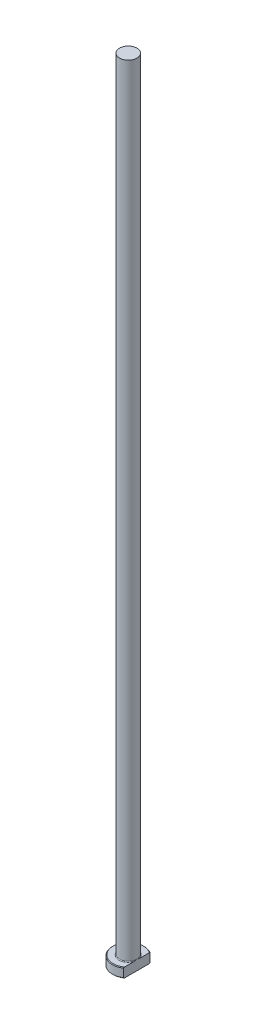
ISO-10303-21;
HEADER;
FILE_DESCRIPTION(('STEP AP214'),'2;1');
FILE_NAME('part.step','',(''),(''),'','','');
FILE_SCHEMA(('AUTOMOTIVE_DESIGN { 1 0 10303 214 1 1 1 1 }'));
ENDSEC;
DATA;
#1=APPLICATION_CONTEXT('core data for automotive mechanical design processes');
#2=APPLICATION_PROTOCOL_DEFINITION('international standard','automotive_design',2000,#1);
#3=PRODUCT_CONTEXT('',#1,'mechanical');
#4=PRODUCT('Part','Part','',(#3));
#5=PRODUCT_RELATED_PRODUCT_CATEGORY('part','',(#4));
#6=PRODUCT_DEFINITION_FORMATION('','',#4);
#7=PRODUCT_DEFINITION_CONTEXT('part definition',#1,'design');
#8=PRODUCT_DEFINITION('design','',#6,#7);
#9=PRODUCT_DEFINITION_SHAPE('','',#8);
#10=(LENGTH_UNIT() NAMED_UNIT(*) SI_UNIT(.MILLI.,.METRE.));
#11=(NAMED_UNIT(*) PLANE_ANGLE_UNIT() SI_UNIT($,.RADIAN.));
#12=(NAMED_UNIT(*) SI_UNIT($,.STERADIAN.) SOLID_ANGLE_UNIT());
#13=UNCERTAINTY_MEASURE_WITH_UNIT(LENGTH_MEASURE(1.E-05),#10,'distance_accuracy_value','');
#14=(GEOMETRIC_REPRESENTATION_CONTEXT(3) GLOBAL_UNCERTAINTY_ASSIGNED_CONTEXT((#13)) GLOBAL_UNIT_ASSIGNED_CONTEXT((#10,
#11,#12)) REPRESENTATION_CONTEXT('',''));
#15=CARTESIAN_POINT('',(0.,0.,0.));
#16=DIRECTION('',(0.,0.,1.));
#17=DIRECTION('',(1.,0.,0.));
#18=AXIS2_PLACEMENT_3D('',#15,#16,#17);
#19=CARTESIAN_POINT('',(0.,0.,0.));
#20=DIRECTION('',(0.,-1.,0.));
#21=DIRECTION('',(0.,0.,-1.));
#22=AXIS2_PLACEMENT_3D('',#19,#20,#21);
#23=PLANE('',#22);
#24=CARTESIAN_POINT('',(0.,0.,0.));
#25=DIRECTION('',(0.,-1.,0.));
#26=DIRECTION('',(0.,0.,-1.));
#27=AXIS2_PLACEMENT_3D('',#24,#25,#26);
#28=CIRCLE('',#27,4.79999999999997);
#29=CARTESIAN_POINT('',(2.74999999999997,0.,3.93414539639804));
#30=VERTEX_POINT('',#29);
#31=CARTESIAN_POINT('',(2.74999999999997,0.,-3.93414539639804));
#32=VERTEX_POINT('',#31);
#33=EDGE_CURVE('E98',#30,#32,#28,.T.);
#34=ORIENTED_EDGE('',*,*,#33,.T.);
#35=DIRECTION('',(0.,0.,1.));
#36=VECTOR('',#35,1.);
#37=CARTESIAN_POINT('',(2.74999999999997,0.,-4.1758232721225));
#38=LINE('',#37,#36);
#39=EDGE_CURVE('E83',#32,#30,#38,.T.);
#40=ORIENTED_EDGE('',*,*,#39,.T.);
#41=EDGE_LOOP('',(#34,#40));
#42=FACE_BOUND('',#41,.T.);
#43=ADVANCED_FACE('F32',(#42),#23,.T.);
#44=CARTESIAN_POINT('',(0.,259.958771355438,0.));
#45=DIRECTION('',(0.,1.,0.));
#46=DIRECTION('',(0.,0.,1.));
#47=AXIS2_PLACEMENT_3D('',#44,#45,#46);
#48=CYLINDRICAL_SURFACE('',#47,4.99999999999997);
#49=CARTESIAN_POINT('',(0.,2.79999999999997,0.));
#50=DIRECTION('',(0.,1.,0.));
#51=DIRECTION('',(0.,0.,1.));
#52=AXIS2_PLACEMENT_3D('',#49,#50,#51);
#53=CIRCLE('',#52,4.99999999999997);
#54=CARTESIAN_POINT('',(2.74999999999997,2.79999999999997,4.1758232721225));
#55=VERTEX_POINT('',#54);
#56=CARTESIAN_POINT('',(2.74999999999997,2.79999999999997,-4.1758232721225));
#57=VERTEX_POINT('',#56);
#58=EDGE_CURVE('E104',#55,#57,#53,.F.);
#59=ORIENTED_EDGE('',*,*,#58,.T.);
#60=DIRECTION('',(0.,-1.,0.));
#61=VECTOR('',#60,1.);
#62=CARTESIAN_POINT('',(2.74999999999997,250.,-4.1758232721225));
#63=LINE('',#62,#61);
#64=CARTESIAN_POINT('',(2.74999999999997,0.200000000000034,-4.1758232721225));
#65=VERTEX_POINT('',#64);
#66=EDGE_CURVE('E183',#57,#65,#63,.T.);
#67=ORIENTED_EDGE('',*,*,#66,.T.);
#68=CARTESIAN_POINT('',(0.,0.200000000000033,0.));
#69=DIRECTION('',(0.,-1.,0.));
#70=DIRECTION('',(0.,0.,-1.));
#71=AXIS2_PLACEMENT_3D('',#68,#69,#70);
#72=CIRCLE('',#71,4.99999999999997);
#73=CARTESIAN_POINT('',(2.74999999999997,0.200000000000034,4.1758232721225));
#74=VERTEX_POINT('',#73);
#75=EDGE_CURVE('E100',#65,#74,#72,.F.);
#76=ORIENTED_EDGE('',*,*,#75,.T.);
#77=DIRECTION('',(0.,-1.,0.));
#78=VECTOR('',#77,1.);
#79=CARTESIAN_POINT('',(2.74999999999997,250.,4.1758232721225));
#80=LINE('',#79,#78);
#81=EDGE_CURVE('E93',#55,#74,#80,.T.);
#82=ORIENTED_EDGE('',*,*,#81,.F.);
#83=EDGE_LOOP('',(#59,#67,#76,#82));
#84=FACE_BOUND('',#83,.T.);
#85=ADVANCED_FACE('F158',(#84),#48,.T.);
#86=CARTESIAN_POINT('',(-4.99999999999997,3.,0.));
#87=DIRECTION('',(0.,1.,0.));
#88=DIRECTION('',(0.,0.,1.));
#89=AXIS2_PLACEMENT_3D('',#86,#87,#88);
#90=PLANE('',#89);
#91=CARTESIAN_POINT('',(0.,3.,0.));
#92=DIRECTION('',(0.,1.,0.));
#93=DIRECTION('',(0.,0.,1.));
#94=AXIS2_PLACEMENT_3D('',#91,#92,#93);
#95=CIRCLE('',#94,4.79999999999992);
#96=CARTESIAN_POINT('',(2.74999999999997,3.,-3.93414539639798));
#97=VERTEX_POINT('',#96);
#98=CARTESIAN_POINT('',(2.74999999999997,3.,3.93414539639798));
#99=VERTEX_POINT('',#98);
#100=EDGE_CURVE('E178',#97,#99,#95,.T.);
#101=ORIENTED_EDGE('',*,*,#100,.T.);
#102=DIRECTION('',(0.,0.,-1.));
#103=VECTOR('',#102,1.);
#104=CARTESIAN_POINT('',(2.74999999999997,3.,0.));
#105=LINE('',#104,#103);
#106=CARTESIAN_POINT('',(2.74999999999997,2.99999999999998,1.06770782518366));
#107=VERTEX_POINT('',#106);
#108=EDGE_CURVE('E57',#99,#107,#105,.T.);
#109=ORIENTED_EDGE('',*,*,#108,.T.);
#110=CARTESIAN_POINT('',(0.,3.,0.));
#111=DIRECTION('',(0.,1.,0.));
#112=DIRECTION('',(0.,0.,1.));
#113=AXIS2_PLACEMENT_3D('',#110,#111,#112);
#114=CIRCLE('',#113,2.94999999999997);
#115=CARTESIAN_POINT('',(2.74999999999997,2.99999999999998,-1.06770782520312));
#116=VERTEX_POINT('',#115);
#117=EDGE_CURVE('E107',#107,#116,#114,.F.);
#118=ORIENTED_EDGE('',*,*,#117,.T.);
#119=EDGE_CURVE('E136',#116,#97,#105,.T.);
#120=ORIENTED_EDGE('',*,*,#119,.T.);
#121=EDGE_LOOP('',(#101,#109,#118,#120));
#122=FACE_BOUND('',#121,.T.);
#123=ADVANCED_FACE('F147',(#122),#90,.T.);
#124=CARTESIAN_POINT('',(0.,3.,0.));
#125=DIRECTION('',(0.,-1.,0.));
#126=DIRECTION('',(0.,0.,-1.));
#127=AXIS2_PLACEMENT_3D('',#124,#125,#126);
#128=CONICAL_SURFACE('',#127,4.79999999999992,0.785398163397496);
#129=ORIENTED_EDGE('',*,*,#58,.F.);
#130=CARTESIAN_POINT('',(2.74999999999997,-1.79114558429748,9.18844783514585));
#131=CARTESIAN_POINT('',(2.74999999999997,-1.62476324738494,9.0147689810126));
#132=CARTESIAN_POINT('',(2.74999999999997,-1.45857819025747,8.84090089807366));
#133=CARTESIAN_POINT('',(2.74999999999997,-1.12668775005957,8.49270511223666));
#134=CARTESIAN_POINT('',(2.74999999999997,-0.960982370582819,8.31837740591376));
#135=CARTESIAN_POINT('',(2.74999999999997,-0.464632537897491,7.79449769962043));
#136=CARTESIAN_POINT('',(2.74999999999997,-0.134839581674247,7.44413786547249));
#137=CARTESIAN_POINT('',(2.74999999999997,0.521406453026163,6.74030951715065));
#138=CARTESIAN_POINT('',(2.74999999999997,0.847859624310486,6.38684108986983));
#139=CARTESIAN_POINT('',(2.74999999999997,1.33353933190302,5.85303151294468));
#140=CARTESIAN_POINT('',(2.74999999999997,1.49475728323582,5.67450358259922));
#141=CARTESIAN_POINT('',(2.74999999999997,1.81545552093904,5.31589537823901));
#142=CARTESIAN_POINT('',(2.74999999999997,1.97493583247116,5.1358151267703));
#143=CARTESIAN_POINT('',(2.74999999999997,2.28246157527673,4.78409714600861));
#144=CARTESIAN_POINT('',(2.74999999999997,2.43063567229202,4.61257212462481));
#145=CARTESIAN_POINT('',(2.74999999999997,2.72427023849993,4.26717959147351));
#146=CARTESIAN_POINT('',(2.74999999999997,2.86973045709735,4.09331186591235));
#147=CARTESIAN_POINT('',(2.74999999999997,3.15716227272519,3.74214491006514));
#148=CARTESIAN_POINT('',(2.74999999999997,3.29912659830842,3.56483970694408));
#149=CARTESIAN_POINT('',(2.74999999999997,3.57763983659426,3.20603939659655));
#150=CARTESIAN_POINT('',(2.74999999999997,3.71418980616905,3.02454511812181));
#151=CARTESIAN_POINT('',(2.74999999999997,3.93857405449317,2.71219163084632));
#152=CARTESIAN_POINT('',(2.74999999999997,4.02851673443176,2.58285434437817));
#153=CARTESIAN_POINT('',(2.74999999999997,4.20308451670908,2.32054245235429));
#154=CARTESIAN_POINT('',(2.74999999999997,4.28770764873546,2.18756652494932));
#155=CARTESIAN_POINT('',(2.74999999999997,4.4493195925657,1.9173567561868));
#156=CARTESIAN_POINT('',(2.74999999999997,4.52632375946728,1.78013224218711));
#157=CARTESIAN_POINT('',(2.74999999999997,4.66966790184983,1.50031327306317));
#158=CARTESIAN_POINT('',(2.74999999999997,4.73601725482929,1.35772367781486));
#159=CARTESIAN_POINT('',(2.74999999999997,4.86065113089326,1.04856386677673));
#160=CARTESIAN_POINT('',(2.74999999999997,4.9170079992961,0.881171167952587));
#161=CARTESIAN_POINT('',(2.74999999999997,4.98102802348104,0.625229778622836));
#162=CARTESIAN_POINT('',(2.74999999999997,4.99893817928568,0.539229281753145));
#163=CARTESIAN_POINT('',(2.74999999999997,5.02707157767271,0.365959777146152));
#164=CARTESIAN_POINT('',(2.74999999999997,5.03729562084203,0.2786909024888));
#165=CARTESIAN_POINT('',(2.74999999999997,5.04949232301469,0.102763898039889));
#166=CARTESIAN_POINT('',(2.74999999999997,5.05138838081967,0.0141003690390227));
#167=CARTESIAN_POINT('',(2.74999999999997,5.04659669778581,-0.162990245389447));
#168=CARTESIAN_POINT('',(2.74999999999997,5.03990892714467,-0.251417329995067));
#169=CARTESIAN_POINT('',(2.74999999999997,5.01835539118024,-0.427430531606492));
#170=CARTESIAN_POINT('',(2.74999999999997,5.00347341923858,-0.515014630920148));
#171=CARTESIAN_POINT('',(2.74999999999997,4.9663672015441,-0.688602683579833));
#172=CARTESIAN_POINT('',(2.74999999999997,4.94414138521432,-0.774606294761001));
#173=CARTESIAN_POINT('',(2.74999999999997,4.88037969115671,-0.988315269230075));
#174=CARTESIAN_POINT('',(2.74999999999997,4.83478497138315,-1.11480587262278));
#175=CARTESIAN_POINT('',(2.74999999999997,4.7327190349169,-1.36329985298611));
#176=CARTESIAN_POINT('',(2.74999999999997,4.67623944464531,-1.48529968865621));
#177=CARTESIAN_POINT('',(2.74999999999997,4.5549822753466,-1.72582737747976));
#178=CARTESIAN_POINT('',(2.74999999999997,4.4901643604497,-1.8443346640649));
#179=CARTESIAN_POINT('',(2.74999999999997,4.38849038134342,-2.01944141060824));
#180=CARTESIAN_POINT('',(2.74999999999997,4.3538638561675,-2.07735876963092));
#181=CARTESIAN_POINT('',(2.74999999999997,4.28331846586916,-2.19239883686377));
#182=CARTESIAN_POINT('',(2.74999999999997,4.24739965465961,-2.24952157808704));
#183=CARTESIAN_POINT('',(2.74999999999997,4.12488368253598,-2.44019263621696));
#184=CARTESIAN_POINT('',(2.74999999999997,4.03574833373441,-2.57211125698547));
#185=CARTESIAN_POINT('',(2.74999999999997,3.8530043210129,-2.83282496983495));
#186=CARTESIAN_POINT('',(2.74999999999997,3.75939460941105,-2.96161931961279));
#187=CARTESIAN_POINT('',(2.74999999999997,3.56878484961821,-3.21681212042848));
#188=CARTESIAN_POINT('',(2.74999999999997,3.47178237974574,-3.34320875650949));
#189=CARTESIAN_POINT('',(2.74999999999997,3.27524323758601,-3.59402090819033));
#190=CARTESIAN_POINT('',(2.74999999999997,3.17570641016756,-3.7184363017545));
#191=CARTESIAN_POINT('',(2.74999999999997,2.97442282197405,-3.96596722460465));
#192=CARTESIAN_POINT('',(2.74999999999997,2.87267126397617,-4.08907884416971));
#193=CARTESIAN_POINT('',(2.74999999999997,2.66760125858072,-4.33399167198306));
#194=CARTESIAN_POINT('',(2.74999999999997,2.56428277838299,-4.45579285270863));
#195=CARTESIAN_POINT('',(2.74999999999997,2.25255029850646,-4.81947940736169));
#196=CARTESIAN_POINT('',(2.74999999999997,2.04226620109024,-5.05976099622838));
#197=CARTESIAN_POINT('',(2.74999999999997,1.61812846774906,-5.53760543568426));
#198=CARTESIAN_POINT('',(2.74999999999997,1.40427119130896,-5.77516503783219));
#199=CARTESIAN_POINT('',(2.74999999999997,0.974157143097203,-6.248143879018));
#200=CARTESIAN_POINT('',(2.74999999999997,0.757900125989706,-6.48356289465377));
#201=CARTESIAN_POINT('',(2.74999999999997,0.323911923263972,-6.95249982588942));
#202=CARTESIAN_POINT('',(2.74999999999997,0.106182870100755,-7.18601971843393));
#203=CARTESIAN_POINT('',(2.74999999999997,-0.330587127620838,-7.65182952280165));
#204=CARTESIAN_POINT('',(2.74999999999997,-0.549628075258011,-7.88411943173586));
#205=CARTESIAN_POINT('',(2.74999999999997,-0.854135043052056,-8.20563072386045));
#206=CARTESIAN_POINT('',(2.74999999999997,-0.939169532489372,-8.29526139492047));
#207=CARTESIAN_POINT('',(2.74999999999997,-1.10939110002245,-8.47440444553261));
#208=CARTESIAN_POINT('',(2.74999999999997,-1.1945781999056,-8.56391680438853));
#209=CARTESIAN_POINT('',(2.74999999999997,-1.36493542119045,-8.74266965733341));
#210=CARTESIAN_POINT('',(2.74999999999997,-1.45010532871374,-8.83191035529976));
#211=CARTESIAN_POINT('',(2.74999999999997,-1.62054776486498,-9.01026683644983));
#212=CARTESIAN_POINT('',(2.74999999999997,-1.7058202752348,-9.09938263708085));
#213=CARTESIAN_POINT('',(2.74999999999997,-1.79114558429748,-9.18844783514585));
#214=B_SPLINE_CURVE_WITH_KNOTS('',3,(#130,#131,#132,#133,#134,#135,#136,#137,#138,#139,#140,
#141,#142,#143,#144,#145,#146,#147,#148,#149,#150,#151,#152,#153,#154,#155,#156,#157,#158,#159,
#160,#161,#162,#163,#164,#165,#166,#167,#168,#169,#170,#171,#172,#173,#174,#175,#176,#177,#178,
#179,#180,#181,#182,#183,#184,#185,#186,#187,#188,#189,#190,#191,#192,#193,#194,#195,#196,#197,
#198,#199,#200,#201,#202,#203,#204,#205,#206,#207,#208,#209,#210,#211,#212,#213),.UNSPECIFIED.,
.F.,.F.,(4,2,2,2,2,2,2,2,2,2,2,2,2,2,2,2,2,2,2,2,2,2,2,2,2,2,2,2,2,2,2,2,2,2,2,2,2,2,2,2,2,4),
(0.,0.721544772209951,1.44309493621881,2.88656432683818,4.32999349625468,5.05163004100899,
5.77325612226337,6.45322671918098,7.13325979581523,7.81460476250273,8.49581607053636,
8.96833065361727,9.4410192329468,9.91273488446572,10.3840330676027,10.9119743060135,
11.1752192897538,11.4384368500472,11.7040704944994,11.9697050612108,12.2358669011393,
12.5020857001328,12.9047274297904,13.3076801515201,13.712661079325,13.9150857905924,
14.1175020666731,14.5949844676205,15.0725792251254,15.5505221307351,16.0284943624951,
16.5076321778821,16.9867800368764,17.9446362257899,18.9035363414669,19.862535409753,
20.8203587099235,21.7781842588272,22.1488332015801,22.5195401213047,22.889621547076,
23.259644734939),.UNSPECIFIED.);
#215=EDGE_CURVE('E135',#55,#99,#214,.T.);
#216=ORIENTED_EDGE('',*,*,#215,.T.);
#217=ORIENTED_EDGE('',*,*,#100,.F.);
#218=EDGE_CURVE('E127',#97,#57,#214,.T.);
#219=ORIENTED_EDGE('',*,*,#218,.T.);
#220=EDGE_LOOP('',(#129,#216,#217,#219));
#221=FACE_BOUND('',#220,.T.);
#222=ADVANCED_FACE('F143',(#221),#128,.T.);
#223=CARTESIAN_POINT('',(0.,0.200000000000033,0.));
#224=DIRECTION('',(0.,1.,0.));
#225=DIRECTION('',(0.,0.,1.));
#226=AXIS2_PLACEMENT_3D('',#223,#224,#225);
#227=CONICAL_SURFACE('',#226,4.99999999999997,0.785398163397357);
#228=ORIENTED_EDGE('',*,*,#75,.F.);
#229=CARTESIAN_POINT('',(2.74999999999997,4.79114558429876,-9.18844783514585));
#230=CARTESIAN_POINT('',(2.74999999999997,4.62476324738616,-9.01476898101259));
#231=CARTESIAN_POINT('',(2.74999999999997,4.45857819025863,-8.84090089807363));
#232=CARTESIAN_POINT('',(2.74999999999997,4.12668775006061,-8.49270511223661));
#233=CARTESIAN_POINT('',(2.74999999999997,3.9609823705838,-8.3183774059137));
#234=CARTESIAN_POINT('',(2.74999999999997,3.4646325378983,-7.79449769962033));
#235=CARTESIAN_POINT('',(2.74999999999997,3.13483958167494,-7.44413786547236));
#236=CARTESIAN_POINT('',(2.74999999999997,2.47859354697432,-6.74030951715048));
#237=CARTESIAN_POINT('',(2.74999999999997,2.15214037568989,-6.38684108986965));
#238=CARTESIAN_POINT('',(2.74999999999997,1.6664606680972,-5.85303151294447));
#239=CARTESIAN_POINT('',(2.74999999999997,1.50524271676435,-5.674503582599));
#240=CARTESIAN_POINT('',(2.74999999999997,1.18454447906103,-5.31589537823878));
#241=CARTESIAN_POINT('',(2.74999999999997,1.02506416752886,-5.13581512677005));
#242=CARTESIAN_POINT('',(2.74999999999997,0.717538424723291,-4.78409714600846));
#243=CARTESIAN_POINT('',(2.74999999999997,0.569364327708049,-4.61257212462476));
#244=CARTESIAN_POINT('',(2.74999999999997,0.275729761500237,-4.26717959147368));
#245=CARTESIAN_POINT('',(2.74999999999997,0.130269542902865,-4.09331186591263));
#246=CARTESIAN_POINT('',(2.74999999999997,-0.157162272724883,-3.74214491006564));
#247=CARTESIAN_POINT('',(2.74999999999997,-0.299126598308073,-3.56483970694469));
#248=CARTESIAN_POINT('',(2.74999999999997,-0.577639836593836,-3.20603939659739));
#249=CARTESIAN_POINT('',(2.74999999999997,-0.714189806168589,-3.02454511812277));
#250=CARTESIAN_POINT('',(2.74999999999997,-0.938574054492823,-2.71219163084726));
#251=CARTESIAN_POINT('',(2.74999999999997,-1.02851673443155,-2.58285434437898));
#252=CARTESIAN_POINT('',(2.74999999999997,-1.20308451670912,-2.32054245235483));
#253=CARTESIAN_POINT('',(2.74999999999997,-1.28770764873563,-2.18756652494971));
#254=CARTESIAN_POINT('',(2.74999999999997,-1.4493195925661,-1.91735675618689));
#255=CARTESIAN_POINT('',(2.74999999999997,-1.52632375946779,-1.78013224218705));
#256=CARTESIAN_POINT('',(2.74999999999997,-1.66966790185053,-1.5003132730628));
#257=CARTESIAN_POINT('',(2.74999999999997,-1.73601725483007,-1.35772367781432));
#258=CARTESIAN_POINT('',(2.74999999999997,-1.86065113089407,-1.04856386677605));
#259=CARTESIAN_POINT('',(2.74999999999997,-1.91700799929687,-0.881171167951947));
#260=CARTESIAN_POINT('',(2.74999999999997,-1.98102802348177,-0.625229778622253));
#261=CARTESIAN_POINT('',(2.74999999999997,-1.99893817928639,-0.53922928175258));
#262=CARTESIAN_POINT('',(2.74999999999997,-2.0270715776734,-0.365959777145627));
#263=CARTESIAN_POINT('',(2.74999999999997,-2.0372956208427,-0.278690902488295));
#264=CARTESIAN_POINT('',(2.74999999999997,-2.04949232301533,-0.102763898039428));
#265=CARTESIAN_POINT('',(2.74999999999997,-2.05138838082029,-0.0141003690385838));
#266=CARTESIAN_POINT('',(2.74999999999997,-2.04659669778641,0.162990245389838));
#267=CARTESIAN_POINT('',(2.74999999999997,-2.03990892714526,0.251417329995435));
#268=CARTESIAN_POINT('',(2.74999999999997,-2.0183553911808,0.42743053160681));
#269=CARTESIAN_POINT('',(2.74999999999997,-2.00347341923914,0.515014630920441));
#270=CARTESIAN_POINT('',(2.74999999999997,-1.96636720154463,0.688602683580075));
#271=CARTESIAN_POINT('',(2.74999999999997,-1.94414138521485,0.774606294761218));
#272=CARTESIAN_POINT('',(2.74999999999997,-1.88037969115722,0.988315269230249));
#273=CARTESIAN_POINT('',(2.74999999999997,-1.83478497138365,1.11480587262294));
#274=CARTESIAN_POINT('',(2.74999999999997,-1.73271903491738,1.36329985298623));
#275=CARTESIAN_POINT('',(2.74999999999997,-1.67623944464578,1.48529968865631));
#276=CARTESIAN_POINT('',(2.74999999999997,-1.55498227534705,1.72582737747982));
#277=CARTESIAN_POINT('',(2.74999999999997,-1.49016436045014,1.84433466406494));
#278=CARTESIAN_POINT('',(2.74999999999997,-1.38849038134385,2.01944141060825));
#279=CARTESIAN_POINT('',(2.74999999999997,-1.35386385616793,2.07735876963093));
#280=CARTESIAN_POINT('',(2.74999999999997,-1.28331846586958,2.19239883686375));
#281=CARTESIAN_POINT('',(2.74999999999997,-1.24739965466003,2.24952157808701));
#282=CARTESIAN_POINT('',(2.74999999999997,-1.12488368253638,2.4401926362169));
#283=CARTESIAN_POINT('',(2.74999999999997,-1.0357483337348,2.57211125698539));
#284=CARTESIAN_POINT('',(2.74999999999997,-0.853004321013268,2.83282496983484));
#285=CARTESIAN_POINT('',(2.74999999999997,-0.759394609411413,2.96161931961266));
#286=CARTESIAN_POINT('',(2.74999999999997,-0.568784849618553,3.21681212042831));
#287=CARTESIAN_POINT('',(2.74999999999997,-0.471782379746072,3.34320875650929));
#288=CARTESIAN_POINT('',(2.74999999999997,-0.275243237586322,3.5940209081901));
#289=CARTESIAN_POINT('',(2.74999999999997,-0.175706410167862,3.71843630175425));
#290=CARTESIAN_POINT('',(2.74999999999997,0.025577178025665,3.96596722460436));
#291=CARTESIAN_POINT('',(2.74999999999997,0.127328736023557,4.0890788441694));
#292=CARTESIAN_POINT('',(2.74999999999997,0.332398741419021,4.33399167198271));
#293=CARTESIAN_POINT('',(2.74999999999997,0.43571722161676,4.45579285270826));
#294=CARTESIAN_POINT('',(2.74999999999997,0.747449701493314,4.81947940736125));
#295=CARTESIAN_POINT('',(2.74999999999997,0.957733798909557,5.0597609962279));
#296=CARTESIAN_POINT('',(2.74999999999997,1.38187153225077,5.5376054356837));
#297=CARTESIAN_POINT('',(2.74999999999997,1.59572880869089,5.77516503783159));
#298=CARTESIAN_POINT('',(2.74999999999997,2.02584285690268,6.24814387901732));
#299=CARTESIAN_POINT('',(2.74999999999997,2.2420998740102,6.48356289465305));
#300=CARTESIAN_POINT('',(2.74999999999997,2.67608807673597,6.95249982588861));
#301=CARTESIAN_POINT('',(2.74999999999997,2.8938171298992,7.18601971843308));
#302=CARTESIAN_POINT('',(2.74999999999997,3.33058712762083,7.65182952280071));
#303=CARTESIAN_POINT('',(2.74999999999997,3.54962807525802,7.88411943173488));
#304=CARTESIAN_POINT('',(2.74999999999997,3.85413504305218,8.20563072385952));
#305=CARTESIAN_POINT('',(2.74999999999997,3.9391695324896,8.29526139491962));
#306=CARTESIAN_POINT('',(2.74999999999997,4.10939110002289,8.47440444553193));
#307=CARTESIAN_POINT('',(2.74999999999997,4.19457819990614,8.56391680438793));
#308=CARTESIAN_POINT('',(2.74999999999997,4.3649354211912,8.74266965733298));
#309=CARTESIAN_POINT('',(2.74999999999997,4.4501053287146,8.83191035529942));
#310=CARTESIAN_POINT('',(2.74999999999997,4.62054776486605,9.01026683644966));
#311=CARTESIAN_POINT('',(2.74999999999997,4.70582027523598,9.09938263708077));
#312=CARTESIAN_POINT('',(2.74999999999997,4.79114558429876,9.18844783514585));
#313=B_SPLINE_CURVE_WITH_KNOTS('',3,(#229,#230,#231,#232,#233,#234,#235,#236,#237,#238,#239,
#240,#241,#242,#243,#244,#245,#246,#247,#248,#249,#250,#251,#252,#253,#254,#255,#256,#257,#258,
#259,#260,#261,#262,#263,#264,#265,#266,#267,#268,#269,#270,#271,#272,#273,#274,#275,#276,#277,
#278,#279,#280,#281,#282,#283,#284,#285,#286,#287,#288,#289,#290,#291,#292,#293,#294,#295,#296,
#297,#298,#299,#300,#301,#302,#303,#304,#305,#306,#307,#308,#309,#310,#311,#312),.UNSPECIFIED.,
.F.,.F.,(4,2,2,2,2,2,2,2,2,2,2,2,2,2,2,2,2,2,2,2,2,2,2,2,2,2,2,2,2,2,2,2,2,2,2,2,2,2,2,2,2,4),
(0.,0.721544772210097,1.4430949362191,2.88656432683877,4.32999349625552,5.05163004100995,
5.77325612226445,6.45322671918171,7.13325979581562,7.81460476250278,8.49581607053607,
8.96833065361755,9.44101923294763,9.91273488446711,10.3840330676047,10.9119743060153,
11.1752192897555,11.4384368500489,11.704070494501,11.9697050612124,12.2358669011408,
12.5020857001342,12.9047274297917,13.3076801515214,13.7126610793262,13.9150857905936,
14.1175020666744,14.5949844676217,15.0725792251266,15.5505221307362,16.0284943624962,
16.5076321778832,16.9867800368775,17.9446362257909,18.9035363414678,19.8625354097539,
20.8203587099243,21.778184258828,22.1488332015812,22.5195401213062,22.889621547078,
23.2596447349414),.UNSPECIFIED.);
#314=EDGE_CURVE('E86',#65,#32,#313,.T.);
#315=ORIENTED_EDGE('',*,*,#314,.T.);
#316=ORIENTED_EDGE('',*,*,#33,.F.);
#317=EDGE_CURVE('E89',#30,#74,#313,.T.);
#318=ORIENTED_EDGE('',*,*,#317,.T.);
#319=EDGE_LOOP('',(#228,#315,#316,#318));
#320=FACE_BOUND('',#319,.T.);
#321=ADVANCED_FACE('F97',(#320),#227,.T.);
#322=CARTESIAN_POINT('',(0.,3.19999999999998,0.));
#323=DIRECTION('',(0.,1.,0.));
#324=DIRECTION('',(0.,0.,1.));
#325=AXIS2_PLACEMENT_3D('',#322,#323,#324);
#326=TOROIDAL_SURFACE('',#325,2.94999999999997,0.2);
#327=CARTESIAN_POINT('',(2.74999999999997,3.19999999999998,0.));
#328=CARTESIAN_POINT('',(2.74999999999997,3.20000050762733,1.12997179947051E-10));
#329=CARTESIAN_POINT('',(2.74999999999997,3.20000101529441,-1.81527532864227E-07));
#330=CARTESIAN_POINT('',(2.74999999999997,3.20000196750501,-6.94840309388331E-07));
#331=CARTESIAN_POINT('',(2.74999999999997,3.20000240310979,-1.03787717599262E-06));
#332=CARTESIAN_POINT('',(2.74999999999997,3.20000330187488,-1.85808127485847E-06));
#333=CARTESIAN_POINT('',(2.74999999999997,3.20000375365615,-2.34835981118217E-06));
#334=CARTESIAN_POINT('',(2.74999999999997,3.20000456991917,-3.3704695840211E-06));
#335=CARTESIAN_POINT('',(2.74999999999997,3.20000493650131,-3.90074158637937E-06));
#336=CARTESIAN_POINT('',(2.74999999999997,3.20000627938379,-5.9326172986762E-06));
#337=CARTESIAN_POINT('',(2.74999999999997,3.20000718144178,-7.48563172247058E-06));
#338=CARTESIAN_POINT('',(2.74999999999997,3.20000868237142,-1.0579008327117E-05));
#339=CARTESIAN_POINT('',(2.74999999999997,3.20000929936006,-1.21109700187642E-05));
#340=CARTESIAN_POINT('',(2.74999999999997,3.2000118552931,-1.85322192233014E-05));
#341=CARTESIAN_POINT('',(2.74999999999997,3.20001373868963,-2.34472711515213E-05));
#342=CARTESIAN_POINT('',(2.74999999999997,3.20001654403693,-3.27779451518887E-05));
#343=CARTESIAN_POINT('',(2.74999999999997,3.20001756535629,-3.71636222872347E-05));
#344=CARTESIAN_POINT('',(2.74999999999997,3.20002495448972,-6.95743732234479E-05));
#345=CARTESIAN_POINT('',(2.74999999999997,3.20003050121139,-9.77394523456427E-05));
#346=CARTESIAN_POINT('',(2.74999999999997,3.20005478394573,-0.000208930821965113));
#347=CARTESIAN_POINT('',(2.74999999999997,3.2000780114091,-0.000290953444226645));
#348=CARTESIAN_POINT('',(2.74999999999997,3.20016837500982,-0.000615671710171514));
#349=CARTESIAN_POINT('',(2.74999999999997,3.20023256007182,-0.0008589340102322));
#350=CARTESIAN_POINT('',(2.74999999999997,3.20048946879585,-0.00182516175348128));
#351=CARTESIAN_POINT('',(2.74999999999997,3.20068588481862,-0.00254739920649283));
#352=CARTESIAN_POINT('',(2.74999999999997,3.20150145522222,-0.0055546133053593));
#353=CARTESIAN_POINT('',(2.74999999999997,3.20211597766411,-0.00784050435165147));
#354=CARTESIAN_POINT('',(2.74999999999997,3.20754641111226,-0.0280301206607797));
#355=CARTESIAN_POINT('',(2.74999999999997,3.2123805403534,-0.0459303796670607));
#356=CARTESIAN_POINT('',(2.74999999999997,3.22182435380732,-0.081029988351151));
#357=CARTESIAN_POINT('',(2.74999999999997,3.226435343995,-0.0982290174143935));
#358=CARTESIAN_POINT('',(2.74999999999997,3.23620184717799,-0.134808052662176));
#359=CARTESIAN_POINT('',(2.74999999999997,3.24135263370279,-0.154189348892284));
#360=CARTESIAN_POINT('',(2.74999999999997,3.25163624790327,-0.193181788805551));
#361=CARTESIAN_POINT('',(2.74999999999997,3.25676827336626,-0.21279314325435));
#362=CARTESIAN_POINT('',(2.74999999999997,3.26905119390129,-0.260223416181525));
#363=CARTESIAN_POINT('',(2.74999999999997,3.27615177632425,-0.288055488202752));
#364=CARTESIAN_POINT('',(2.74999999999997,3.28988618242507,-0.343037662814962));
#365=CARTESIAN_POINT('',(2.74999999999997,3.29652742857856,-0.370185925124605));
#366=CARTESIAN_POINT('',(2.74999999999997,3.3179119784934,-0.460013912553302));
#367=CARTESIAN_POINT('',(2.74999999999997,3.33192996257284,-0.522872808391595));
#368=CARTESIAN_POINT('',(2.74999999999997,3.35724782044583,-0.649858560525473));
#369=CARTESIAN_POINT('',(2.74999999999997,3.36851625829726,-0.713991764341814));
#370=CARTESIAN_POINT('',(2.74999999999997,3.38744836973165,-0.848144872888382));
#371=CARTESIAN_POINT('',(2.74999999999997,3.39474814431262,-0.918222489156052));
#372=CARTESIAN_POINT('',(2.74999999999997,3.39971832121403,-1.02344881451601));
#373=CARTESIAN_POINT('',(2.74999999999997,3.40038441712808,-1.05845158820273));
#374=CARTESIAN_POINT('',(2.74999999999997,3.39917295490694,-1.12840448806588));
#375=CARTESIAN_POINT('',(2.74999999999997,3.39729798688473,-1.16335463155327));
#376=CARTESIAN_POINT('',(2.74999999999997,3.39199994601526,-1.21505383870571));
#377=CARTESIAN_POINT('',(2.74999999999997,3.38986571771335,-1.23193598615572));
#378=CARTESIAN_POINT('',(2.74999999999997,3.38464996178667,-1.26557152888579));
#379=CARTESIAN_POINT('',(2.74999999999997,3.38156766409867,-1.28232480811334));
#380=CARTESIAN_POINT('',(2.74999999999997,3.37431364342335,-1.31540767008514));
#381=CARTESIAN_POINT('',(2.74999999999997,3.37015411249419,-1.33173987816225));
#382=CARTESIAN_POINT('',(2.74999999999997,3.36048976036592,-1.36399299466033));
#383=CARTESIAN_POINT('',(2.74999999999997,3.35498646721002,-1.37991434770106));
#384=CARTESIAN_POINT('',(2.74999999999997,3.34222746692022,-1.41123903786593));
#385=CARTESIAN_POINT('',(2.74999999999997,3.33495457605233,-1.42663549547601));
#386=CARTESIAN_POINT('',(2.74999999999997,3.318175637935,-1.45617471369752));
#387=CARTESIAN_POINT('',(2.74999999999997,3.30867792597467,-1.4703218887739));
#388=CARTESIAN_POINT('',(2.74999999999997,3.29277007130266,-1.48907990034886));
#389=CARTESIAN_POINT('',(2.74999999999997,3.2875192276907,-1.49466894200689));
#390=CARTESIAN_POINT('',(2.74999999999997,3.27634440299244,-1.50515028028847));
#391=CARTESIAN_POINT('',(2.74999999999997,3.27042002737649,-1.51004216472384));
#392=CARTESIAN_POINT('',(2.74999999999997,3.25778482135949,-1.51891099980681));
#393=CARTESIAN_POINT('',(2.74999999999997,3.2510643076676,-1.52287446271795));
#394=CARTESIAN_POINT('',(2.74999999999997,3.23698143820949,-1.5294174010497));
#395=CARTESIAN_POINT('',(2.74999999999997,3.22962116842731,-1.53200119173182));
#396=CARTESIAN_POINT('',(2.74999999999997,3.2166326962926,-1.53496289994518));
#397=CARTESIAN_POINT('',(2.74999999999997,3.2110985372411,-1.53575651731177));
#398=CARTESIAN_POINT('',(2.74999999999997,3.19997558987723,-1.53638738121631));
#399=CARTESIAN_POINT('',(2.74999999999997,3.19438682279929,-1.53622498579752));
#400=CARTESIAN_POINT('',(2.74999999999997,3.18332943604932,-1.53495937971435));
#401=CARTESIAN_POINT('',(2.74999999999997,3.17786061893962,-1.53385785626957));
#402=CARTESIAN_POINT('',(2.74999999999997,3.16716525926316,-1.53080991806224));
#403=CARTESIAN_POINT('',(2.74999999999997,3.16193889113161,-1.52886290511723));
#404=CARTESIAN_POINT('',(2.74999999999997,3.14983366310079,-1.52335528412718));
#405=CARTESIAN_POINT('',(2.74999999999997,3.14310699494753,-1.51946144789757));
#406=CARTESIAN_POINT('',(2.74999999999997,3.13035821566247,-1.51065443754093));
#407=CARTESIAN_POINT('',(2.74999999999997,3.12433789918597,-1.50573875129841));
#408=CARTESIAN_POINT('',(2.74999999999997,3.10956608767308,-1.4920109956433));
#409=CARTESIAN_POINT('',(2.74999999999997,3.10134587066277,-1.48263193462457));
#410=CARTESIAN_POINT('',(2.74999999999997,3.08638427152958,-1.46278796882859));
#411=CARTESIAN_POINT('',(2.74999999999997,3.07964511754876,-1.45232146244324));
#412=CARTESIAN_POINT('',(2.74999999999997,3.06171675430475,-1.42080727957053));
#413=CARTESIAN_POINT('',(2.74999999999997,3.05211924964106,-1.39886385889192));
#414=CARTESIAN_POINT('',(2.74999999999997,3.03592584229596,-1.35377597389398));
#415=CARTESIAN_POINT('',(2.74999999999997,3.02935693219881,-1.33062268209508));
#416=CARTESIAN_POINT('',(2.74999999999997,3.01641276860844,-1.27469229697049));
#417=CARTESIAN_POINT('',(2.74999999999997,3.01110503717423,-1.24167224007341));
#418=CARTESIAN_POINT('',(2.74999999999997,3.00364182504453,-1.17522319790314));
#419=CARTESIAN_POINT('',(2.74999999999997,3.00149608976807,-1.14179326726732));
#420=CARTESIAN_POINT('',(2.74999999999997,2.99965905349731,-1.0761846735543));
#421=CARTESIAN_POINT('',(2.74999999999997,2.9998750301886,-1.04400821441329));
#422=CARTESIAN_POINT('',(2.74999999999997,3.00208041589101,-0.979705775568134));
#423=CARTESIAN_POINT('',(2.74999999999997,3.00407086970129,-0.94757983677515));
#424=CARTESIAN_POINT('',(2.74999999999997,3.01231998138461,-0.849711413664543));
#425=CARTESIAN_POINT('',(2.74999999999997,3.02086596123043,-0.784164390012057));
#426=CARTESIAN_POINT('',(2.74999999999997,3.04217753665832,-0.652153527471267));
#427=CARTESIAN_POINT('',(2.74999999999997,3.05504187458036,-0.585706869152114));
#428=CARTESIAN_POINT('',(2.74999999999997,3.07899589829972,-0.474257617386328));
#429=CARTESIAN_POINT('',(2.74999999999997,3.08936705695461,-0.429096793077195));
#430=CARTESIAN_POINT('',(2.74999999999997,3.11088695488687,-0.339494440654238));
#431=CARTESIAN_POINT('',(2.74999999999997,3.12202574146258,-0.295050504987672));
#432=CARTESIAN_POINT('',(2.74999999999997,3.14355229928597,-0.211341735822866));
#433=CARTESIAN_POINT('',(2.74999999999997,3.15388178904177,-0.17206169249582));
#434=CARTESIAN_POINT('',(2.74999999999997,3.17523671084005,-0.0918970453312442));
#435=CARTESIAN_POINT('',(2.74999999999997,3.18627305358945,-0.0510152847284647));
#436=CARTESIAN_POINT('',(2.74999999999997,3.19788514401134,-0.00783595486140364));
#437=CARTESIAN_POINT('',(2.74999999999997,3.19850096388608,-0.00554554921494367));
#438=CARTESIAN_POINT('',(2.74999999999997,3.19931683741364,-0.00253730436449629));
#439=CARTESIAN_POINT('',(2.74999999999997,3.19951229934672,-0.00181855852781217));
#440=CARTESIAN_POINT('',(2.74999999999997,3.19976804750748,-0.000856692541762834));
#441=CARTESIAN_POINT('',(2.74999999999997,3.19983200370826,-0.000614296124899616));
#442=CARTESIAN_POINT('',(2.74999999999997,3.19992209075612,-0.000290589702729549));
#443=CARTESIAN_POINT('',(2.74999999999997,3.19994527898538,-0.000208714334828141));
#444=CARTESIAN_POINT('',(2.74999999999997,3.19996952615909,-9.76928428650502E-05));
#445=CARTESIAN_POINT('',(2.74999999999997,3.19997506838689,-6.95486157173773E-05));
#446=CARTESIAN_POINT('',(2.74999999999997,3.19998244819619,-3.71590915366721E-05));
#447=CARTESIAN_POINT('',(2.74999999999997,3.1999834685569,-3.2774592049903E-05));
#448=CARTESIAN_POINT('',(2.74999999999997,3.19998627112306,-2.34463157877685E-05));
#449=CARTESIAN_POINT('',(2.74999999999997,3.19998815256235,-1.85324214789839E-05));
#450=CARTESIAN_POINT('',(2.74999999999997,3.19999070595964,-1.21123670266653E-05));
#451=CARTESIAN_POINT('',(2.74999999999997,3.19999132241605,-1.05804935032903E-05));
#452=CARTESIAN_POINT('',(2.74999999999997,3.1999928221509,-7.4872040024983E-06));
#453=CARTESIAN_POINT('',(2.74999999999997,3.19999372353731,-5.93417784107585E-06));
#454=CARTESIAN_POINT('',(2.74999999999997,3.19999506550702,-3.90218205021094E-06));
#455=CARTESIAN_POINT('',(2.74999999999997,3.19999543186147,-3.37184999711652E-06));
#456=CARTESIAN_POINT('',(2.74999999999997,3.19999624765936,-2.3495790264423E-06));
#457=CARTESIAN_POINT('',(2.74999999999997,3.1999966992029,-1.85919798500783E-06));
#458=CARTESIAN_POINT('',(2.74999999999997,3.19999759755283,-1.03875218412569E-06));
#459=CARTESIAN_POINT('',(2.74999999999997,3.19999803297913,-6.95584891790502E-07));
#460=CARTESIAN_POINT('',(2.74999999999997,3.19999898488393,-1.81944076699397E-07));
#461=CARTESIAN_POINT('',(2.74999999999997,3.1999994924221,-1.12986168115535E-10));
#462=CARTESIAN_POINT('',(2.74999999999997,3.19999999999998,0.));
#463=B_SPLINE_CURVE_WITH_KNOTS('',3,(#327,#328,#329,#330,#331,#332,#333,#334,#335,#336,#337,
#338,#339,#340,#341,#342,#343,#344,#345,#346,#347,#348,#349,#350,#351,#352,#353,#354,#355,#356,
#357,#358,#359,#360,#361,#362,#363,#364,#365,#366,#367,#368,#369,#370,#371,#372,#373,#374,#375,
#376,#377,#378,#379,#380,#381,#382,#383,#384,#385,#386,#387,#388,#389,#390,#391,#392,#393,#394,
#395,#396,#397,#398,#399,#400,#401,#402,#403,#404,#405,#406,#407,#408,#409,#410,#411,#412,#413,
#414,#415,#416,#417,#418,#419,#420,#421,#422,#423,#424,#425,#426,#427,#428,#429,#430,#431,#432,
#433,#434,#435,#436,#437,#438,#439,#440,#441,#442,#443,#444,#445,#446,#447,#448,#449,#450,#451,
#452,#453,#454,#455,#456,#457,#458,#459,#460,#461,#462),.UNSPECIFIED.,.T.,.F.,(4,2,2,2,2,2,2,2,
2,2,2,2,2,2,2,2,2,2,2,2,2,2,2,2,2,2,2,2,2,2,2,2,2,2,2,2,2,2,2,2,2,2,2,2,2,2,2,2,2,2,2,2,2,2,2,2,
2,2,2,2,2,2,2,2,2,2,2,4),(0.,1.53302763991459E-06,3.19538931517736E-06,5.18410400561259E-06,
7.11680710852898E-06,1.24843266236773E-05,1.74346122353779E-05,3.3195428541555E-05,
4.66876455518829E-05,0.000132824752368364,0.000388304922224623,0.00114333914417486,
0.0033884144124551,0.0104899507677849,0.0661127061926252,0.119532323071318,0.179694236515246,
0.240509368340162,0.326678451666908,0.410524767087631,0.603684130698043,0.798958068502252,
1.00997653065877,1.11494231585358,1.21980118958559,1.27083021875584,1.32190080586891,
1.37241688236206,1.42287578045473,1.4738457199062,1.52462767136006,1.54758745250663,
1.57056075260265,1.59384955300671,1.61706507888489,1.6337610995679,1.65045086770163,
1.66711071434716,1.68378236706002,1.70696786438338,1.73021104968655,1.76741395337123,
1.80467244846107,1.87612299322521,1.94819858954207,2.0482867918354,2.14868283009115,
2.24515187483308,2.34167775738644,2.53976637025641,2.74273377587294,2.88173187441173,
3.01918106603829,3.14102752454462,3.268058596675,3.27517420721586,3.27740842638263,
3.27816077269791,3.27841579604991,3.27850186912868,3.27851535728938,3.27853111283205,
3.27853606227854,3.27854142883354,3.27854336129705,3.27854534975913,3.27854701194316,
3.2785485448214),.UNSPECIFIED.);
#464=CARTESIAN_POINT('',(2.74999999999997,3.19999999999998,0.));
#465=VERTEX_POINT('',#464);
#466=EDGE_CURVE('E11',#116,#465,#463,.T.);
#467=ORIENTED_EDGE('',*,*,#466,.F.);
#468=ORIENTED_EDGE('',*,*,#117,.F.);
#469=CARTESIAN_POINT('',(2.74999999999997,3.19999999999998,0.));
#470=CARTESIAN_POINT('',(2.74999999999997,3.19999949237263,-1.12997235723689E-10));
#471=CARTESIAN_POINT('',(2.74999999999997,3.19999898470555,1.8152753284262E-07));
#472=CARTESIAN_POINT('',(2.74999999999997,3.19999803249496,6.94840309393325E-07));
#473=CARTESIAN_POINT('',(2.74999999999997,3.19999759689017,1.03787717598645E-06));
#474=CARTESIAN_POINT('',(2.74999999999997,3.19999669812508,1.85808127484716E-06));
#475=CARTESIAN_POINT('',(2.74999999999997,3.19999624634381,2.34835981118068E-06));
#476=CARTESIAN_POINT('',(2.74999999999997,3.19999543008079,3.37046958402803E-06));
#477=CARTESIAN_POINT('',(2.74999999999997,3.19999506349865,3.90074158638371E-06));
#478=CARTESIAN_POINT('',(2.74999999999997,3.19999372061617,5.93261729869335E-06));
#479=CARTESIAN_POINT('',(2.74999999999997,3.19999281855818,7.48563172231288E-06));
#480=CARTESIAN_POINT('',(2.74999999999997,3.19999131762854,1.05790083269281E-05));
#481=CARTESIAN_POINT('',(2.74999999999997,3.1999907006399,1.21109700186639E-05));
#482=CARTESIAN_POINT('',(2.74999999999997,3.19998814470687,1.85322192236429E-05));
#483=CARTESIAN_POINT('',(2.74999999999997,3.19998626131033,2.34472711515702E-05));
#484=CARTESIAN_POINT('',(2.74999999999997,3.19998345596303,3.27779451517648E-05));
#485=CARTESIAN_POINT('',(2.74999999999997,3.19998243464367,3.71636222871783E-05));
#486=CARTESIAN_POINT('',(2.74999999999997,3.19997504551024,6.95743732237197E-05));
#487=CARTESIAN_POINT('',(2.74999999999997,3.19996949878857,9.77394523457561E-05));
#488=CARTESIAN_POINT('',(2.74999999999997,3.19994521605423,0.000208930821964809));
#489=CARTESIAN_POINT('',(2.74999999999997,3.19992198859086,0.000290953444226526));
#490=CARTESIAN_POINT('',(2.74999999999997,3.19983162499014,0.000615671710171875));
#491=CARTESIAN_POINT('',(2.74999999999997,3.19976743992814,0.000858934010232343));
#492=CARTESIAN_POINT('',(2.74999999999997,3.19951053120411,0.00182516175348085));
#493=CARTESIAN_POINT('',(2.74999999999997,3.19931411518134,0.00254739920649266));
#494=CARTESIAN_POINT('',(2.74999999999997,3.19849854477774,0.00555461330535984));
#495=CARTESIAN_POINT('',(2.74999999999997,3.19788402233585,0.00784050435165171));
#496=CARTESIAN_POINT('',(2.74999999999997,3.1924535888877,0.0280301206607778));
#497=CARTESIAN_POINT('',(2.74999999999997,3.18761945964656,0.0459303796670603));
#498=CARTESIAN_POINT('',(2.74999999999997,3.17817564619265,0.0810299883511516));
#499=CARTESIAN_POINT('',(2.74999999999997,3.17356465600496,0.0982290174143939));
#500=CARTESIAN_POINT('',(2.74999999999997,3.16379815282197,0.134808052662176));
#501=CARTESIAN_POINT('',(2.74999999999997,3.15864736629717,0.154189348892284));
#502=CARTESIAN_POINT('',(2.74999999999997,3.14836375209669,0.193181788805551));
#503=CARTESIAN_POINT('',(2.74999999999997,3.1432317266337,0.21279314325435));
#504=CARTESIAN_POINT('',(2.74999999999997,3.13094880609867,0.260223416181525));
#505=CARTESIAN_POINT('',(2.74999999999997,3.12384822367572,0.288055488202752));
#506=CARTESIAN_POINT('',(2.74999999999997,3.1101138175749,0.343037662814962));
#507=CARTESIAN_POINT('',(2.74999999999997,3.1034725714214,0.370185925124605));
#508=CARTESIAN_POINT('',(2.74999999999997,3.08208802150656,0.460013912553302));
#509=CARTESIAN_POINT('',(2.74999999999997,3.06807003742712,0.522872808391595));
#510=CARTESIAN_POINT('',(2.74999999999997,3.04275217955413,0.649858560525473));
#511=CARTESIAN_POINT('',(2.74999999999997,3.03148374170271,0.713991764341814));
#512=CARTESIAN_POINT('',(2.74999999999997,3.01255163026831,0.848144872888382));
#513=CARTESIAN_POINT('',(2.74999999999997,3.00525185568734,0.918222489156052));
#514=CARTESIAN_POINT('',(2.74999999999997,3.00028167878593,1.02344881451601));
#515=CARTESIAN_POINT('',(2.74999999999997,2.99961558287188,1.05845158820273));
#516=CARTESIAN_POINT('',(2.74999999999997,3.00082704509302,1.12840448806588));
#517=CARTESIAN_POINT('',(2.74999999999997,3.00270201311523,1.16335463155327));
#518=CARTESIAN_POINT('',(2.74999999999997,3.0080000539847,1.21505383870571));
#519=CARTESIAN_POINT('',(2.74999999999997,3.01013428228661,1.23193598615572));
#520=CARTESIAN_POINT('',(2.74999999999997,3.01535003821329,1.26557152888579));
#521=CARTESIAN_POINT('',(2.74999999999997,3.01843233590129,1.28232480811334));
#522=CARTESIAN_POINT('',(2.74999999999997,3.02568635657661,1.31540767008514));
#523=CARTESIAN_POINT('',(2.74999999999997,3.02984588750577,1.33173987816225));
#524=CARTESIAN_POINT('',(2.74999999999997,3.03951023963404,1.36399299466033));
#525=CARTESIAN_POINT('',(2.74999999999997,3.04501353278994,1.37991434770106));
#526=CARTESIAN_POINT('',(2.74999999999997,3.05777253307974,1.41123903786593));
#527=CARTESIAN_POINT('',(2.74999999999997,3.06504542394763,1.42663549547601));
#528=CARTESIAN_POINT('',(2.74999999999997,3.08182436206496,1.45617471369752));
#529=CARTESIAN_POINT('',(2.74999999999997,3.09132207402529,1.4703218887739));
#530=CARTESIAN_POINT('',(2.74999999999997,3.1072299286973,1.48907990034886));
#531=CARTESIAN_POINT('',(2.74999999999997,3.11248077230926,1.49466894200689));
#532=CARTESIAN_POINT('',(2.74999999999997,3.12365559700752,1.50515028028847));
#533=CARTESIAN_POINT('',(2.74999999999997,3.12957997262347,1.51004216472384));
#534=CARTESIAN_POINT('',(2.74999999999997,3.14221517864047,1.51891099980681));
#535=CARTESIAN_POINT('',(2.74999999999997,3.14893569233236,1.52287446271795));
#536=CARTESIAN_POINT('',(2.74999999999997,3.16301856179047,1.5294174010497));
#537=CARTESIAN_POINT('',(2.74999999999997,3.17037883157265,1.53200119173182));
#538=CARTESIAN_POINT('',(2.74999999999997,3.18336730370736,1.53496289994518));
#539=CARTESIAN_POINT('',(2.74999999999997,3.18890146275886,1.53575651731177));
#540=CARTESIAN_POINT('',(2.74999999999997,3.20002441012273,1.53638738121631));
#541=CARTESIAN_POINT('',(2.74999999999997,3.20561317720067,1.53622498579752));
#542=CARTESIAN_POINT('',(2.74999999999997,3.21667056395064,1.53495937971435));
#543=CARTESIAN_POINT('',(2.74999999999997,3.22213938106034,1.53385785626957));
#544=CARTESIAN_POINT('',(2.74999999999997,3.2328347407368,1.53080991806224));
#545=CARTESIAN_POINT('',(2.74999999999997,3.23806110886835,1.52886290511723));
#546=CARTESIAN_POINT('',(2.74999999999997,3.25016633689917,1.52335528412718));
#547=CARTESIAN_POINT('',(2.74999999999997,3.25689300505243,1.51946144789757));
#548=CARTESIAN_POINT('',(2.74999999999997,3.26964178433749,1.51065443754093));
#549=CARTESIAN_POINT('',(2.74999999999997,3.27566210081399,1.50573875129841));
#550=CARTESIAN_POINT('',(2.74999999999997,3.29043391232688,1.4920109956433));
#551=CARTESIAN_POINT('',(2.74999999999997,3.29865412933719,1.48263193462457));
#552=CARTESIAN_POINT('',(2.74999999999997,3.31361572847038,1.46278796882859));
#553=CARTESIAN_POINT('',(2.74999999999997,3.3203548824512,1.45232146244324));
#554=CARTESIAN_POINT('',(2.74999999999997,3.33828324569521,1.42080727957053));
#555=CARTESIAN_POINT('',(2.74999999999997,3.34788075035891,1.39886385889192));
#556=CARTESIAN_POINT('',(2.74999999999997,3.364074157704,1.35377597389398));
#557=CARTESIAN_POINT('',(2.74999999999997,3.37064306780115,1.33062268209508));
#558=CARTESIAN_POINT('',(2.74999999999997,3.38358723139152,1.27469229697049));
#559=CARTESIAN_POINT('',(2.74999999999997,3.38889496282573,1.24167224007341));
#560=CARTESIAN_POINT('',(2.74999999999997,3.39635817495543,1.17522319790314));
#561=CARTESIAN_POINT('',(2.74999999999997,3.39850391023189,1.14179326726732));
#562=CARTESIAN_POINT('',(2.74999999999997,3.40034094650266,1.0761846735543));
#563=CARTESIAN_POINT('',(2.74999999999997,3.40012496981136,1.04400821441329));
#564=CARTESIAN_POINT('',(2.74999999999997,3.39791958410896,0.979705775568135));
#565=CARTESIAN_POINT('',(2.74999999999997,3.39592913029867,0.947579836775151));
#566=CARTESIAN_POINT('',(2.74999999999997,3.38768001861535,0.849711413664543));
#567=CARTESIAN_POINT('',(2.74999999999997,3.37913403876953,0.784164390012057));
#568=CARTESIAN_POINT('',(2.74999999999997,3.35782246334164,0.652153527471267));
#569=CARTESIAN_POINT('',(2.74999999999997,3.3449581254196,0.585706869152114));
#570=CARTESIAN_POINT('',(2.74999999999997,3.32100410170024,0.474257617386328));
#571=CARTESIAN_POINT('',(2.74999999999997,3.31063294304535,0.429096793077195));
#572=CARTESIAN_POINT('',(2.74999999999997,3.28911304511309,0.339494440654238));
#573=CARTESIAN_POINT('',(2.74999999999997,3.27797425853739,0.295050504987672));
#574=CARTESIAN_POINT('',(2.74999999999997,3.25644770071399,0.211341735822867));
#575=CARTESIAN_POINT('',(2.74999999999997,3.24611821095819,0.172061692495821));
#576=CARTESIAN_POINT('',(2.74999999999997,3.22476328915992,0.0918970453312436));
#577=CARTESIAN_POINT('',(2.74999999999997,3.21372694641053,0.0510152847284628));
#578=CARTESIAN_POINT('',(2.74999999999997,3.20211485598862,0.00783595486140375));
#579=CARTESIAN_POINT('',(2.74999999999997,3.20149903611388,0.00554554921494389));
#580=CARTESIAN_POINT('',(2.74999999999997,3.20068316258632,0.00253730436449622));
#581=CARTESIAN_POINT('',(2.74999999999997,3.20048770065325,0.001818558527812));
#582=CARTESIAN_POINT('',(2.74999999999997,3.20023195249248,0.000856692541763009));
#583=CARTESIAN_POINT('',(2.74999999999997,3.2001679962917,0.000614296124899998));
#584=CARTESIAN_POINT('',(2.74999999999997,3.20007790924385,0.000290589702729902));
#585=CARTESIAN_POINT('',(2.74999999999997,3.20005472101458,0.000208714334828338));
#586=CARTESIAN_POINT('',(2.74999999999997,3.20003047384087,9.76928428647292E-05));
#587=CARTESIAN_POINT('',(2.74999999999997,3.20002493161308,6.95486157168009E-05));
#588=CARTESIAN_POINT('',(2.74999999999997,3.20001755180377,3.7159091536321E-05));
#589=CARTESIAN_POINT('',(2.74999999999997,3.20001653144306,3.2774592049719E-05));
#590=CARTESIAN_POINT('',(2.74999999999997,3.2000137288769,2.34463157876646E-05));
#591=CARTESIAN_POINT('',(2.74999999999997,3.20001184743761,1.85324214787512E-05));
#592=CARTESIAN_POINT('',(2.74999999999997,3.20000929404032,1.21123670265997E-05));
#593=CARTESIAN_POINT('',(2.74999999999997,3.20000867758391,1.05804935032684E-05));
#594=CARTESIAN_POINT('',(2.74999999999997,3.20000717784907,7.48720400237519E-06));
#595=CARTESIAN_POINT('',(2.74999999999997,3.20000627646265,5.93417784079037E-06));
#596=CARTESIAN_POINT('',(2.74999999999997,3.20000493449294,3.9021820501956E-06));
#597=CARTESIAN_POINT('',(2.74999999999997,3.20000456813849,3.37184999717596E-06));
#598=CARTESIAN_POINT('',(2.74999999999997,3.2000037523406,2.34957902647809E-06));
#599=CARTESIAN_POINT('',(2.74999999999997,3.20000330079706,1.85919798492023E-06));
#600=CARTESIAN_POINT('',(2.74999999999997,3.20000240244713,1.0387521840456E-06));
#601=CARTESIAN_POINT('',(2.74999999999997,3.20000196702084,6.95584891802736E-07));
#602=CARTESIAN_POINT('',(2.74999999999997,3.20000101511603,1.8194407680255E-07));
#603=CARTESIAN_POINT('',(2.74999999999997,3.20000050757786,1.12986223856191E-10));
#604=CARTESIAN_POINT('',(2.74999999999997,3.19999999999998,0.));
#605=B_SPLINE_CURVE_WITH_KNOTS('',3,(#469,#470,#471,#472,#473,#474,#475,#476,#477,#478,#479,
#480,#481,#482,#483,#484,#485,#486,#487,#488,#489,#490,#491,#492,#493,#494,#495,#496,#497,#498,
#499,#500,#501,#502,#503,#504,#505,#506,#507,#508,#509,#510,#511,#512,#513,#514,#515,#516,#517,
#518,#519,#520,#521,#522,#523,#524,#525,#526,#527,#528,#529,#530,#531,#532,#533,#534,#535,#536,
#537,#538,#539,#540,#541,#542,#543,#544,#545,#546,#547,#548,#549,#550,#551,#552,#553,#554,#555,
#556,#557,#558,#559,#560,#561,#562,#563,#564,#565,#566,#567,#568,#569,#570,#571,#572,#573,#574,
#575,#576,#577,#578,#579,#580,#581,#582,#583,#584,#585,#586,#587,#588,#589,#590,#591,#592,#593,
#594,#595,#596,#597,#598,#599,#600,#601,#602,#603,#604),.UNSPECIFIED.,.T.,.F.,(4,2,2,2,2,2,2,2,
2,2,2,2,2,2,2,2,2,2,2,2,2,2,2,2,2,2,2,2,2,2,2,2,2,2,2,2,2,2,2,2,2,2,2,2,2,2,2,2,2,2,2,2,2,2,2,2,
2,2,2,2,2,2,2,2,2,2,2,4),(0.,1.53302763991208E-06,3.19538931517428E-06,5.18410400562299E-06,
7.11680710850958E-06,1.24843266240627E-05,1.74346122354E-05,3.31954285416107E-05,
4.66876455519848E-05,0.000132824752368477,0.000388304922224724,0.00114333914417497,
0.0033884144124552,0.010489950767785,0.0661127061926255,0.119532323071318,0.179694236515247,
0.240509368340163,0.326678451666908,0.410524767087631,0.603684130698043,0.798958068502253,
1.00997653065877,1.11494231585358,1.21980118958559,1.27083021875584,1.32190080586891,
1.37241688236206,1.42287578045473,1.4738457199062,1.52462767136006,1.54758745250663,
1.57056075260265,1.59384955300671,1.61706507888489,1.6337610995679,1.65045086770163,
1.66711071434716,1.68378236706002,1.70696786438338,1.73021104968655,1.76741395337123,
1.80467244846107,1.87612299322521,1.94819858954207,2.0482867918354,2.14868283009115,
2.24515187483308,2.34167775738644,2.53976637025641,2.74273377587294,2.88173187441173,
3.01918106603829,3.14102752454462,3.268058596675,3.27517420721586,3.27740842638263,
3.27816077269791,3.27841579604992,3.27850186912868,3.27851535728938,3.27853111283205,
3.27853606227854,3.27854142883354,3.27854336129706,3.27854534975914,3.27854701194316,
3.27854854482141),.UNSPECIFIED.);
#606=EDGE_CURVE('E46',#465,#107,#605,.T.);
#607=ORIENTED_EDGE('',*,*,#606,.F.);
#608=CARTESIAN_POINT('',(0.,3.19999999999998,0.));
#609=DIRECTION('',(0.,1.,0.));
#610=DIRECTION('',(0.,0.,1.));
#611=AXIS2_PLACEMENT_3D('',#608,#609,#610);
#612=CIRCLE('',#611,2.74999999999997);
#613=EDGE_CURVE('E103',#465,#465,#612,.T.);
#614=ORIENTED_EDGE('',*,*,#613,.F.);
#615=EDGE_LOOP('',(#467,#468,#607,#614));
#616=FACE_BOUND('',#615,.T.);
#617=ADVANCED_FACE('F34',(#616),#326,.F.);
#618=CARTESIAN_POINT('',(0.,259.958771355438,0.));
#619=DIRECTION('',(0.,1.,0.));
#620=DIRECTION('',(0.,0.,1.));
#621=AXIS2_PLACEMENT_3D('',#618,#619,#620);
#622=CYLINDRICAL_SURFACE('',#621,2.74999999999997);
#623=ORIENTED_EDGE('',*,*,#613,.T.);
#624=EDGE_LOOP('',(#623));
#625=FACE_BOUND('',#624,.T.);
#626=CARTESIAN_POINT('',(0.,250.,0.));
#627=DIRECTION('',(0.,1.,0.));
#628=DIRECTION('',(0.,0.,1.));
#629=AXIS2_PLACEMENT_3D('',#626,#627,#628);
#630=CIRCLE('',#629,2.74999999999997);
#631=CARTESIAN_POINT('',(0.,250.,2.74999999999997));
#632=VERTEX_POINT('',#631);
#633=EDGE_CURVE('E101',#632,#632,#630,.T.);
#634=ORIENTED_EDGE('',*,*,#633,.F.);
#635=EDGE_LOOP('',(#634));
#636=FACE_BOUND('',#635,.T.);
#637=ADVANCED_FACE('F155',(#625,#636),#622,.T.);
#638=CARTESIAN_POINT('',(-2.74999999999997,250.,0.));
#639=DIRECTION('',(0.,1.,0.));
#640=DIRECTION('',(0.,0.,1.));
#641=AXIS2_PLACEMENT_3D('',#638,#639,#640);
#642=PLANE('',#641);
#643=ORIENTED_EDGE('',*,*,#633,.T.);
#644=EDGE_LOOP('',(#643));
#645=FACE_BOUND('',#644,.T.);
#646=ADVANCED_FACE('F121',(#645),#642,.T.);
#647=CARTESIAN_POINT('',(2.74999999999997,250.,-4.1758232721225));
#648=DIRECTION('',(1.,0.,0.));
#649=DIRECTION('',(0.,0.,-1.));
#650=AXIS2_PLACEMENT_3D('',#647,#648,#649);
#651=PLANE('',#650);
#652=ORIENTED_EDGE('',*,*,#66,.F.);
#653=ORIENTED_EDGE('',*,*,#218,.F.);
#654=ORIENTED_EDGE('',*,*,#119,.F.);
#655=ORIENTED_EDGE('',*,*,#466,.T.);
#656=ORIENTED_EDGE('',*,*,#606,.T.);
#657=ORIENTED_EDGE('',*,*,#108,.F.);
#658=ORIENTED_EDGE('',*,*,#215,.F.);
#659=ORIENTED_EDGE('',*,*,#81,.T.);
#660=ORIENTED_EDGE('',*,*,#317,.F.);
#661=ORIENTED_EDGE('',*,*,#39,.F.);
#662=ORIENTED_EDGE('',*,*,#314,.F.);
#663=EDGE_LOOP('',(#652,#653,#654,#655,#656,#657,#658,#659,#660,#661,#662));
#664=FACE_BOUND('',#663,.T.);
#665=ADVANCED_FACE('F85',(#664),#651,.T.);
#666=CLOSED_SHELL('',(#43,#85,#123,#222,#321,#617,#637,#646,#665));
#667=MANIFOLD_SOLID_BREP('B2',#666);
#668=ADVANCED_BREP_SHAPE_REPRESENTATION('',(#18,#667),#14);
#669=SHAPE_DEFINITION_REPRESENTATION(#9,#668);
ENDSEC;
END-ISO-10303-21;
